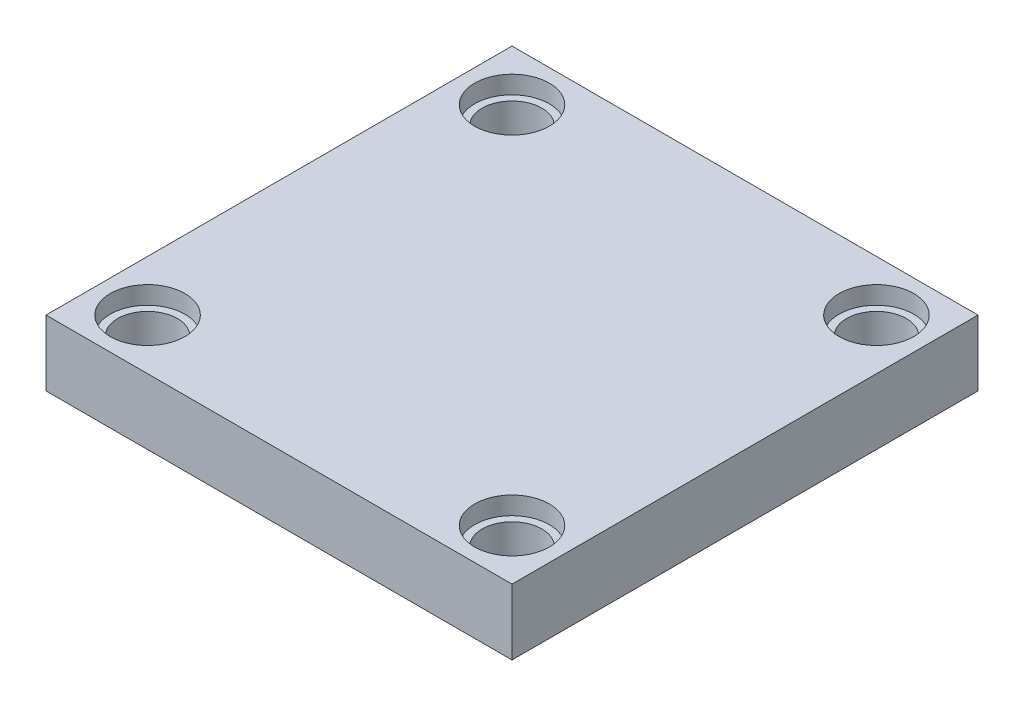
from build123d import *

# Parameters (mm, degrees)
ESBO_O1_W       = 156
ESBO_O1_H       = 156
EXTRUS_O1_DEPTH = 22
ESBO_O2_R       = 10
EXTRUS_O2_DEPTH = 113.481109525
ESBO_O3_R       = 12.5
EXTRUS_O3_DEPTH = 6


with BuildPart() as part:
    # Esbo_o1 → Extrus_o1 (new body)
    with BuildSketch(Plane(origin=(0, 0, 0), x_dir=(1, 0, 0), z_dir=(0, 1, 0))):
        Rectangle(ESBO_O1_W, ESBO_O1_H)
    extrude(amount=EXTRUS_O1_DEPTH)

    # Esbo_o2 → Extrus_o2 (cut, through all)
    with BuildSketch(Plane.XZ):
        with Locations(Location((61, 61, 0), (0, 0, 270))):
            Circle(ESBO_O2_R)
        with Locations(Location((-61, 61, 0), (0, 0, 270))):
            Circle(ESBO_O2_R)
        with Locations(Location((61, -61, 0), (0, 0, 270))):
            Circle(ESBO_O2_R)
        with Locations(Location((-61, -61, 0), (0, 0, 270))):
            Circle(ESBO_O2_R)
    extrude(amount=-EXTRUS_O2_DEPTH, mode=Mode.SUBTRACT)

    # Esbo_o3 → Extrus_o3 (cut)
    with BuildSketch(Plane(origin=(0, 22, 0), x_dir=(1, 0, 0), z_dir=(0, 1, 0))):
        with Locations(Location((-61, 61, 0), (0, 0, 270))):
            Circle(ESBO_O3_R)
        with Locations(Location((61, 61, 0), (0, 0, 270))):
            Circle(ESBO_O3_R)
        with Locations(Location((-61, -61, 0), (0, 0, 270))):
            Circle(ESBO_O3_R)
        with Locations(Location((61, -61, 0), (0, 0, 270))):
            Circle(ESBO_O3_R)
    extrude(amount=-EXTRUS_O3_DEPTH, mode=Mode.SUBTRACT)


solid = part.part
